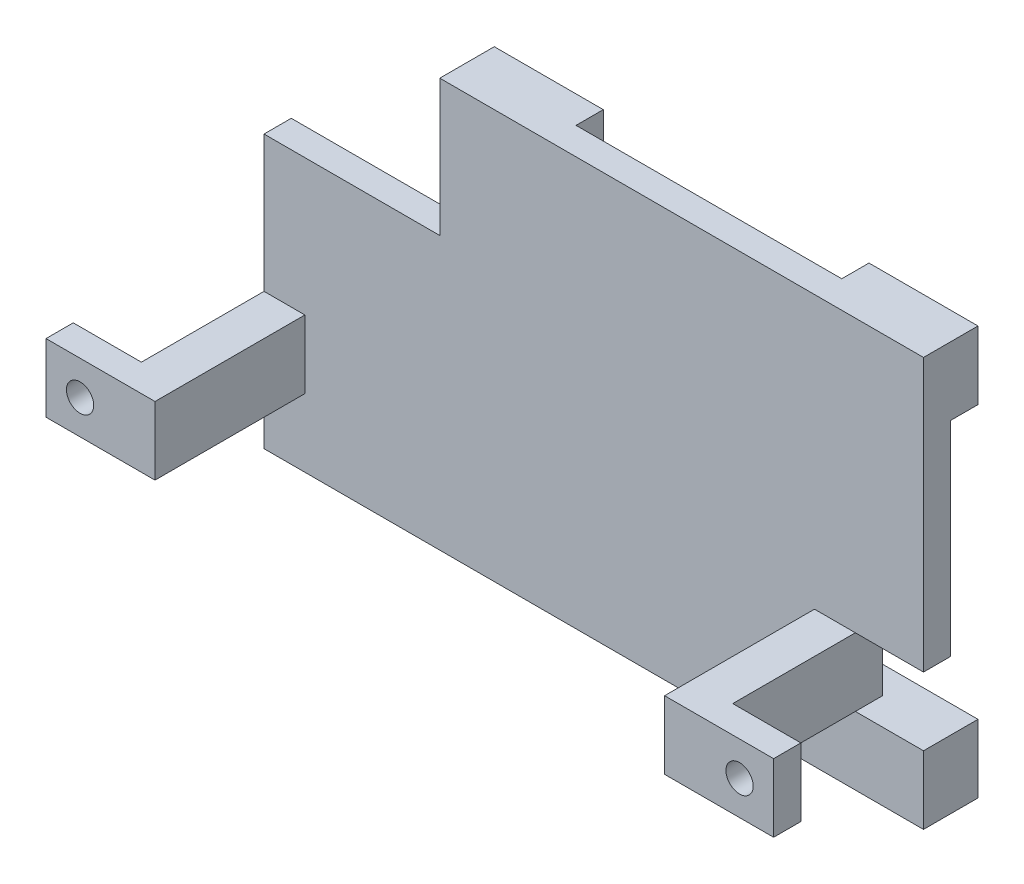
ISO-10303-21;
HEADER;
FILE_DESCRIPTION(('STEP AP214'),'2;1');
FILE_NAME('part.step','',(''),(''),'','','');
FILE_SCHEMA(('AUTOMOTIVE_DESIGN { 1 0 10303 214 1 1 1 1 }'));
ENDSEC;
DATA;
#1=APPLICATION_CONTEXT('core data for automotive mechanical design processes');
#2=APPLICATION_PROTOCOL_DEFINITION('international standard','automotive_design',2000,#1);
#3=PRODUCT_CONTEXT('',#1,'mechanical');
#4=PRODUCT('Part','Part','',(#3));
#5=PRODUCT_RELATED_PRODUCT_CATEGORY('part','',(#4));
#6=PRODUCT_DEFINITION_FORMATION('','',#4);
#7=PRODUCT_DEFINITION_CONTEXT('part definition',#1,'design');
#8=PRODUCT_DEFINITION('design','',#6,#7);
#9=PRODUCT_DEFINITION_SHAPE('','',#8);
#10=(LENGTH_UNIT() NAMED_UNIT(*) SI_UNIT(.MILLI.,.METRE.));
#11=(NAMED_UNIT(*) PLANE_ANGLE_UNIT() SI_UNIT($,.RADIAN.));
#12=(NAMED_UNIT(*) SI_UNIT($,.STERADIAN.) SOLID_ANGLE_UNIT());
#13=UNCERTAINTY_MEASURE_WITH_UNIT(LENGTH_MEASURE(1.E-05),#10,'distance_accuracy_value','');
#14=(GEOMETRIC_REPRESENTATION_CONTEXT(3) GLOBAL_UNCERTAINTY_ASSIGNED_CONTEXT((#13)) GLOBAL_UNIT_ASSIGNED_CONTEXT((#10,
#11,#12)) REPRESENTATION_CONTEXT('',''));
#15=CARTESIAN_POINT('',(0.,0.,0.));
#16=DIRECTION('',(0.,0.,1.));
#17=DIRECTION('',(1.,0.,0.));
#18=AXIS2_PLACEMENT_3D('',#15,#16,#17);
#19=CARTESIAN_POINT('',(-0.387630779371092,-16.6710198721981,0.));
#20=DIRECTION('',(0.,0.,1.));
#21=DIRECTION('',(1.,0.,0.));
#22=AXIS2_PLACEMENT_3D('',#19,#20,#21);
#23=PLANE('',#22);
#24=DIRECTION('',(0.,-1.,0.));
#25=VECTOR('',#24,1.);
#26=CARTESIAN_POINT('',(-0.387630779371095,13.3289801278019,0.));
#27=LINE('',#26,#25);
#28=CARTESIAN_POINT('',(-0.387630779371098,3.32898012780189,0.));
#29=VERTEX_POINT('',#28);
#30=CARTESIAN_POINT('',(-0.387630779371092,-16.6710198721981,0.));
#31=VERTEX_POINT('',#30);
#32=EDGE_CURVE('E307',#29,#31,#27,.T.);
#33=ORIENTED_EDGE('',*,*,#32,.F.);
#34=DIRECTION('',(-1.,0.,0.));
#35=VECTOR('',#34,1.);
#36=CARTESIAN_POINT('',(-0.387630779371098,3.32898012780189,0.));
#37=LINE('',#36,#35);
#38=CARTESIAN_POINT('',(12.5123692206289,3.32898012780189,0.));
#39=VERTEX_POINT('',#38);
#40=EDGE_CURVE('E287',#39,#29,#37,.T.);
#41=ORIENTED_EDGE('',*,*,#40,.F.);
#42=DIRECTION('',(0.,-1.,0.));
#43=VECTOR('',#42,1.);
#44=CARTESIAN_POINT('',(12.5123692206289,13.3289801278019,0.));
#45=LINE('',#44,#43);
#46=CARTESIAN_POINT('',(12.5123692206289,8.32898012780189,0.));
#47=VERTEX_POINT('',#46);
#48=EDGE_CURVE('E297',#47,#39,#45,.T.);
#49=ORIENTED_EDGE('',*,*,#48,.F.);
#50=DIRECTION('',(-1.,0.,0.));
#51=VECTOR('',#50,1.);
#52=CARTESIAN_POINT('',(12.5123692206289,8.32898012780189,0.));
#53=LINE('',#52,#51);
#54=CARTESIAN_POINT('',(20.5123692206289,8.32898012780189,0.));
#55=VERTEX_POINT('',#54);
#56=EDGE_CURVE('E350',#55,#47,#53,.T.);
#57=ORIENTED_EDGE('',*,*,#56,.F.);
#58=DIRECTION('',(0.,-1.,0.));
#59=VECTOR('',#58,1.);
#60=CARTESIAN_POINT('',(20.5123692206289,13.3289801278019,0.));
#61=LINE('',#60,#59);
#62=CARTESIAN_POINT('',(20.5123692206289,13.3289801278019,0.));
#63=VERTEX_POINT('',#62);
#64=EDGE_CURVE('E343',#63,#55,#61,.T.);
#65=ORIENTED_EDGE('',*,*,#64,.F.);
#66=DIRECTION('',(-1.,0.,0.));
#67=VECTOR('',#66,1.);
#68=CARTESIAN_POINT('',(-0.387630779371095,13.3289801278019,0.));
#69=LINE('',#68,#67);
#70=CARTESIAN_POINT('',(40.0123692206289,13.3289801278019,0.));
#71=VERTEX_POINT('',#70);
#72=EDGE_CURVE('E512',#71,#63,#69,.T.);
#73=ORIENTED_EDGE('',*,*,#72,.F.);
#74=DIRECTION('',(0.,1.,0.));
#75=VECTOR('',#74,1.);
#76=CARTESIAN_POINT('',(40.0123692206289,13.3289801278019,0.));
#77=LINE('',#76,#75);
#78=CARTESIAN_POINT('',(40.0123692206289,8.32898012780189,0.));
#79=VERTEX_POINT('',#78);
#80=EDGE_CURVE('E325',#79,#71,#77,.T.);
#81=ORIENTED_EDGE('',*,*,#80,.F.);
#82=DIRECTION('',(-1.,0.,0.));
#83=VECTOR('',#82,1.);
#84=CARTESIAN_POINT('',(48.0123692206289,8.32898012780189,0.));
#85=LINE('',#84,#83);
#86=CARTESIAN_POINT('',(48.0123692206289,8.32898012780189,0.));
#87=VERTEX_POINT('',#86);
#88=EDGE_CURVE('E318',#87,#79,#85,.T.);
#89=ORIENTED_EDGE('',*,*,#88,.F.);
#90=DIRECTION('',(0.,1.,0.));
#91=VECTOR('',#90,1.);
#92=CARTESIAN_POINT('',(48.0123692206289,13.3289801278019,0.));
#93=LINE('',#92,#91);
#94=CARTESIAN_POINT('',(48.0123692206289,-6.67101987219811,0.));
#95=VERTEX_POINT('',#94);
#96=EDGE_CURVE('E502',#95,#87,#93,.T.);
#97=ORIENTED_EDGE('',*,*,#96,.F.);
#98=DIRECTION('',(-1.,0.,0.));
#99=VECTOR('',#98,1.);
#100=CARTESIAN_POINT('',(43.0123692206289,-6.67101987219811,0.));
#101=LINE('',#100,#99);
#102=CARTESIAN_POINT('',(43.0123692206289,-6.67101987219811,0.));
#103=VERTEX_POINT('',#102);
#104=EDGE_CURVE('E1050',#95,#103,#101,.T.);
#105=ORIENTED_EDGE('',*,*,#104,.T.);
#106=DIRECTION('',(0.,-1.,0.));
#107=VECTOR('',#106,1.);
#108=CARTESIAN_POINT('',(43.0123692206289,-11.6710198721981,0.));
#109=LINE('',#108,#107);
#110=CARTESIAN_POINT('',(43.0123692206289,-11.6710198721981,0.));
#111=VERTEX_POINT('',#110);
#112=EDGE_CURVE('E1053',#103,#111,#109,.T.);
#113=ORIENTED_EDGE('',*,*,#112,.T.);
#114=DIRECTION('',(1.,0.,0.));
#115=VECTOR('',#114,1.);
#116=CARTESIAN_POINT('',(48.0123692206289,-11.6710198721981,0.));
#117=LINE('',#116,#115);
#118=CARTESIAN_POINT('',(40.0123692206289,-11.6710198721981,0.));
#119=VERTEX_POINT('',#118);
#120=EDGE_CURVE('E90',#119,#111,#117,.T.);
#121=ORIENTED_EDGE('',*,*,#120,.F.);
#122=DIRECTION('',(0.,1.,0.));
#123=VECTOR('',#122,1.);
#124=CARTESIAN_POINT('',(40.0123692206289,-16.6710198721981,0.));
#125=LINE('',#124,#123);
#126=CARTESIAN_POINT('',(40.0123692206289,-16.6710198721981,0.));
#127=VERTEX_POINT('',#126);
#128=EDGE_CURVE('E371',#127,#119,#125,.T.);
#129=ORIENTED_EDGE('',*,*,#128,.F.);
#130=DIRECTION('',(1.,0.,0.));
#131=VECTOR('',#130,1.);
#132=CARTESIAN_POINT('',(-0.387630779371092,-16.6710198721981,0.));
#133=LINE('',#132,#131);
#134=CARTESIAN_POINT('',(20.5123692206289,-16.6710198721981,0.));
#135=VERTEX_POINT('',#134);
#136=EDGE_CURVE('E503',#135,#127,#133,.T.);
#137=ORIENTED_EDGE('',*,*,#136,.F.);
#138=DIRECTION('',(0.,-1.,0.));
#139=VECTOR('',#138,1.);
#140=CARTESIAN_POINT('',(20.5123692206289,-16.6710198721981,0.));
#141=LINE('',#140,#139);
#142=CARTESIAN_POINT('',(20.5123692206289,-11.6710198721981,0.));
#143=VERTEX_POINT('',#142);
#144=EDGE_CURVE('E404',#143,#135,#141,.T.);
#145=ORIENTED_EDGE('',*,*,#144,.F.);
#146=DIRECTION('',(1.,0.,0.));
#147=VECTOR('',#146,1.);
#148=CARTESIAN_POINT('',(12.5123692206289,-11.6710198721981,0.));
#149=LINE('',#148,#147);
#150=CARTESIAN_POINT('',(12.5123692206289,-11.6710198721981,0.));
#151=VERTEX_POINT('',#150);
#152=EDGE_CURVE('E411',#151,#143,#149,.T.);
#153=ORIENTED_EDGE('',*,*,#152,.F.);
#154=DIRECTION('',(0.,1.,0.));
#155=VECTOR('',#154,1.);
#156=CARTESIAN_POINT('',(12.5123692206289,-16.6710198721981,0.));
#157=LINE('',#156,#155);
#158=CARTESIAN_POINT('',(12.5123692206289,-16.6710198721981,0.));
#159=VERTEX_POINT('',#158);
#160=EDGE_CURVE('E397',#159,#151,#157,.T.);
#161=ORIENTED_EDGE('',*,*,#160,.F.);
#162=EDGE_CURVE('E498',#31,#159,#133,.T.);
#163=ORIENTED_EDGE('',*,*,#162,.F.);
#164=EDGE_LOOP('',(#33,#41,#49,#57,#65,#73,#81,#89,#97,#105,#113,#121,#129,#137,#145,#153,#161,#163));
#165=FACE_BOUND('',#164,.T.);
#166=ADVANCED_FACE('F64',(#165),#23,.F.);
#167=CARTESIAN_POINT('',(-0.387630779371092,-16.6710198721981,2.));
#168=DIRECTION('',(0.,0.,1.));
#169=DIRECTION('',(1.,0.,0.));
#170=AXIS2_PLACEMENT_3D('',#167,#168,#169);
#171=PLANE('',#170);
#172=DIRECTION('',(1.,0.,0.));
#173=VECTOR('',#172,1.);
#174=CARTESIAN_POINT('',(-0.387630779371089,3.32898012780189,2.));
#175=LINE('',#174,#173);
#176=CARTESIAN_POINT('',(-0.387630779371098,3.32898012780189,2.));
#177=VERTEX_POINT('',#176);
#178=CARTESIAN_POINT('',(12.5123692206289,3.32898012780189,2.));
#179=VERTEX_POINT('',#178);
#180=EDGE_CURVE('E290',#177,#179,#175,.T.);
#181=ORIENTED_EDGE('',*,*,#180,.F.);
#182=DIRECTION('',(0.,-1.,0.));
#183=VECTOR('',#182,1.);
#184=CARTESIAN_POINT('',(-0.387630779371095,13.3289801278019,2.));
#185=LINE('',#184,#183);
#186=CARTESIAN_POINT('',(-0.387630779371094,-6.67101987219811,2.));
#187=VERTEX_POINT('',#186);
#188=EDGE_CURVE('E68',#177,#187,#185,.T.);
#189=ORIENTED_EDGE('',*,*,#188,.T.);
#190=DIRECTION('',(-1.,0.,0.));
#191=VECTOR('',#190,1.);
#192=CARTESIAN_POINT('',(-0.387630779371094,-6.67101987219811,2.));
#193=LINE('',#192,#191);
#194=CARTESIAN_POINT('',(2.6123692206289,-6.67101987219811,2.));
#195=VERTEX_POINT('',#194);
#196=EDGE_CURVE('E520',#195,#187,#193,.T.);
#197=ORIENTED_EDGE('',*,*,#196,.F.);
#198=DIRECTION('',(0.,1.,0.));
#199=VECTOR('',#198,1.);
#200=CARTESIAN_POINT('',(2.6123692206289,-11.6710198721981,2.));
#201=LINE('',#200,#199);
#202=CARTESIAN_POINT('',(2.6123692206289,-11.6710198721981,2.));
#203=VERTEX_POINT('',#202);
#204=EDGE_CURVE('E1025',#203,#195,#201,.T.);
#205=ORIENTED_EDGE('',*,*,#204,.F.);
#206=DIRECTION('',(1.,0.,0.));
#207=VECTOR('',#206,1.);
#208=CARTESIAN_POINT('',(-0.387630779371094,-11.6710198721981,2.));
#209=LINE('',#208,#207);
#210=CARTESIAN_POINT('',(-0.387630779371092,-11.6710198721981,2.));
#211=VERTEX_POINT('',#210);
#212=EDGE_CURVE('E1027',#211,#203,#209,.T.);
#213=ORIENTED_EDGE('',*,*,#212,.F.);
#214=CARTESIAN_POINT('',(-0.387630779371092,-16.6710198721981,2.));
#215=VERTEX_POINT('',#214);
#216=EDGE_CURVE('E514',#211,#215,#185,.T.);
#217=ORIENTED_EDGE('',*,*,#216,.T.);
#218=DIRECTION('',(1.,0.,0.));
#219=VECTOR('',#218,1.);
#220=CARTESIAN_POINT('',(-0.387630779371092,-16.6710198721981,2.));
#221=LINE('',#220,#219);
#222=CARTESIAN_POINT('',(48.0123692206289,-16.6710198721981,2.));
#223=VERTEX_POINT('',#222);
#224=EDGE_CURVE('E527',#215,#223,#221,.T.);
#225=ORIENTED_EDGE('',*,*,#224,.T.);
#226=DIRECTION('',(0.,1.,0.));
#227=VECTOR('',#226,1.);
#228=CARTESIAN_POINT('',(48.0123692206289,13.3289801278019,2.));
#229=LINE('',#228,#227);
#230=CARTESIAN_POINT('',(48.0123692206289,-11.6710198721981,2.));
#231=VERTEX_POINT('',#230);
#232=EDGE_CURVE('E531',#223,#231,#229,.T.);
#233=ORIENTED_EDGE('',*,*,#232,.T.);
#234=DIRECTION('',(1.,0.,0.));
#235=VECTOR('',#234,1.);
#236=CARTESIAN_POINT('',(48.0123692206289,-11.6710198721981,2.));
#237=LINE('',#236,#235);
#238=CARTESIAN_POINT('',(43.0123692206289,-11.6710198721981,2.));
#239=VERTEX_POINT('',#238);
#240=EDGE_CURVE('E1054',#239,#231,#237,.T.);
#241=ORIENTED_EDGE('',*,*,#240,.F.);
#242=DIRECTION('',(1.,0.,0.));
#243=VECTOR('',#242,1.);
#244=CARTESIAN_POINT('',(43.0123692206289,-11.6710198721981,2.));
#245=LINE('',#244,#243);
#246=CARTESIAN_POINT('',(40.0123692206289,-11.6710198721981,2.));
#247=VERTEX_POINT('',#246);
#248=EDGE_CURVE('E1109',#247,#239,#245,.T.);
#249=ORIENTED_EDGE('',*,*,#248,.F.);
#250=DIRECTION('',(0.,-1.,0.));
#251=VECTOR('',#250,1.);
#252=CARTESIAN_POINT('',(40.0123692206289,-6.67101987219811,2.));
#253=LINE('',#252,#251);
#254=CARTESIAN_POINT('',(40.0123692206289,-6.67101987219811,2.));
#255=VERTEX_POINT('',#254);
#256=EDGE_CURVE('E1113',#255,#247,#253,.T.);
#257=ORIENTED_EDGE('',*,*,#256,.F.);
#258=DIRECTION('',(-1.,0.,0.));
#259=VECTOR('',#258,1.);
#260=CARTESIAN_POINT('',(43.0123692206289,-6.67101987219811,2.));
#261=LINE('',#260,#259);
#262=CARTESIAN_POINT('',(43.0123692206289,-6.67101987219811,2.));
#263=VERTEX_POINT('',#262);
#264=EDGE_CURVE('E1073',#263,#255,#261,.T.);
#265=ORIENTED_EDGE('',*,*,#264,.F.);
#266=DIRECTION('',(-1.,0.,0.));
#267=VECTOR('',#266,1.);
#268=CARTESIAN_POINT('',(43.0123692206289,-6.67101987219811,2.));
#269=LINE('',#268,#267);
#270=CARTESIAN_POINT('',(48.0123692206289,-6.67101987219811,2.));
#271=VERTEX_POINT('',#270);
#272=EDGE_CURVE('E1034',#271,#263,#269,.T.);
#273=ORIENTED_EDGE('',*,*,#272,.F.);
#274=CARTESIAN_POINT('',(48.0123692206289,13.3289801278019,2.));
#275=VERTEX_POINT('',#274);
#276=EDGE_CURVE('E530',#271,#275,#229,.T.);
#277=ORIENTED_EDGE('',*,*,#276,.T.);
#278=DIRECTION('',(-1.,0.,0.));
#279=VECTOR('',#278,1.);
#280=CARTESIAN_POINT('',(-0.387630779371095,13.3289801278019,2.));
#281=LINE('',#280,#279);
#282=CARTESIAN_POINT('',(12.5123692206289,13.3289801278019,2.));
#283=VERTEX_POINT('',#282);
#284=EDGE_CURVE('E517',#275,#283,#281,.T.);
#285=ORIENTED_EDGE('',*,*,#284,.T.);
#286=DIRECTION('',(0.,1.,0.));
#287=VECTOR('',#286,1.);
#288=CARTESIAN_POINT('',(12.5123692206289,-16.6710198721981,2.));
#289=LINE('',#288,#287);
#290=EDGE_CURVE('E310',#179,#283,#289,.T.);
#291=ORIENTED_EDGE('',*,*,#290,.F.);
#292=EDGE_LOOP('',(#181,#189,#197,#205,#213,#217,#225,#233,#241,#249,#257,#265,#273,#277,#285,#291));
#293=FACE_BOUND('',#292,.T.);
#294=ADVANCED_FACE('F536',(#293),#171,.T.);
#295=CARTESIAN_POINT('',(48.0123692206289,13.3289801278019,2.));
#296=DIRECTION('',(-1.,0.,0.));
#297=DIRECTION('',(0.,-1.,0.));
#298=AXIS2_PLACEMENT_3D('',#295,#296,#297);
#299=PLANE('',#298);
#300=DIRECTION('',(0.,0.,-1.));
#301=VECTOR('',#300,1.);
#302=CARTESIAN_POINT('',(48.0123692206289,-16.6710198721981,2.));
#303=LINE('',#302,#301);
#304=CARTESIAN_POINT('',(48.0123692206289,-16.6710198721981,-2.));
#305=VERTEX_POINT('',#304);
#306=EDGE_CURVE('E74',#223,#305,#303,.T.);
#307=ORIENTED_EDGE('',*,*,#306,.T.);
#308=DIRECTION('',(0.,-1.,0.));
#309=VECTOR('',#308,1.);
#310=CARTESIAN_POINT('',(48.0123692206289,-16.6710198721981,-2.));
#311=LINE('',#310,#309);
#312=CARTESIAN_POINT('',(48.0123692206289,-11.6710198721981,-2.));
#313=VERTEX_POINT('',#312);
#314=EDGE_CURVE('E382',#313,#305,#311,.T.);
#315=ORIENTED_EDGE('',*,*,#314,.F.);
#316=DIRECTION('',(0.,0.,1.));
#317=VECTOR('',#316,1.);
#318=CARTESIAN_POINT('',(48.0123692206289,-11.6710198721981,0.));
#319=LINE('',#318,#317);
#320=EDGE_CURVE('E1059',#313,#231,#319,.T.);
#321=ORIENTED_EDGE('',*,*,#320,.T.);
#322=ORIENTED_EDGE('',*,*,#232,.F.);
#323=EDGE_LOOP('',(#307,#315,#321,#322));
#324=FACE_BOUND('',#323,.T.);
#325=ADVANCED_FACE('F574',(#324),#299,.F.);
#326=CARTESIAN_POINT('',(-0.387630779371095,13.3289801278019,2.));
#327=DIRECTION('',(1.,0.,0.));
#328=DIRECTION('',(0.,1.,0.));
#329=AXIS2_PLACEMENT_3D('',#326,#327,#328);
#330=PLANE('',#329);
#331=ORIENTED_EDGE('',*,*,#188,.F.);
#332=DIRECTION('',(0.,0.,-1.));
#333=VECTOR('',#332,1.);
#334=CARTESIAN_POINT('',(-0.387630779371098,3.32898012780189,10.));
#335=LINE('',#334,#333);
#336=EDGE_CURVE('E294',#177,#29,#335,.T.);
#337=ORIENTED_EDGE('',*,*,#336,.T.);
#338=ORIENTED_EDGE('',*,*,#32,.T.);
#339=DIRECTION('',(0.,0.,-1.));
#340=VECTOR('',#339,1.);
#341=CARTESIAN_POINT('',(-0.387630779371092,-16.6710198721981,2.));
#342=LINE('',#341,#340);
#343=EDGE_CURVE('E12',#215,#31,#342,.T.);
#344=ORIENTED_EDGE('',*,*,#343,.F.);
#345=ORIENTED_EDGE('',*,*,#216,.F.);
#346=DIRECTION('',(0.,0.,-1.));
#347=VECTOR('',#346,1.);
#348=CARTESIAN_POINT('',(-0.387630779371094,-11.6710198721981,13.));
#349=LINE('',#348,#347);
#350=CARTESIAN_POINT('',(-0.387630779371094,-11.6710198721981,11.));
#351=VERTEX_POINT('',#350);
#352=EDGE_CURVE('E1048',#351,#211,#349,.T.);
#353=ORIENTED_EDGE('',*,*,#352,.F.);
#354=DIRECTION('',(0.,1.,0.));
#355=VECTOR('',#354,1.);
#356=CARTESIAN_POINT('',(-0.387630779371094,-11.6710198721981,11.));
#357=LINE('',#356,#355);
#358=CARTESIAN_POINT('',(-0.387630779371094,-6.67101987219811,11.));
#359=VERTEX_POINT('',#358);
#360=EDGE_CURVE('E481',#351,#359,#357,.T.);
#361=ORIENTED_EDGE('',*,*,#360,.T.);
#362=DIRECTION('',(0.,0.,-1.));
#363=VECTOR('',#362,1.);
#364=CARTESIAN_POINT('',(-0.387630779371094,-6.67101987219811,13.));
#365=LINE('',#364,#363);
#366=EDGE_CURVE('E487',#359,#187,#365,.T.);
#367=ORIENTED_EDGE('',*,*,#366,.T.);
#368=EDGE_LOOP('',(#331,#337,#338,#344,#345,#353,#361,#367));
#369=FACE_BOUND('',#368,.T.);
#370=ADVANCED_FACE('F66',(#369),#330,.F.);
#371=CARTESIAN_POINT('',(-0.387630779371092,-16.6710198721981,2.));
#372=DIRECTION('',(0.,1.,0.));
#373=DIRECTION('',(0.,0.,1.));
#374=AXIS2_PLACEMENT_3D('',#371,#372,#373);
#375=PLANE('',#374);
#376=ORIENTED_EDGE('',*,*,#162,.T.);
#377=DIRECTION('',(0.,0.,1.));
#378=VECTOR('',#377,1.);
#379=CARTESIAN_POINT('',(12.5123692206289,-16.6710198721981,-2.));
#380=LINE('',#379,#378);
#381=CARTESIAN_POINT('',(12.5123692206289,-16.6710198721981,-2.));
#382=VERTEX_POINT('',#381);
#383=EDGE_CURVE('E436',#382,#159,#380,.T.);
#384=ORIENTED_EDGE('',*,*,#383,.F.);
#385=DIRECTION('',(-1.,0.,0.));
#386=VECTOR('',#385,1.);
#387=CARTESIAN_POINT('',(12.5123692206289,-16.6710198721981,-2.));
#388=LINE('',#387,#386);
#389=CARTESIAN_POINT('',(20.5123692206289,-16.6710198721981,-2.));
#390=VERTEX_POINT('',#389);
#391=EDGE_CURVE('E400',#390,#382,#388,.T.);
#392=ORIENTED_EDGE('',*,*,#391,.F.);
#393=DIRECTION('',(0.,0.,1.));
#394=VECTOR('',#393,1.);
#395=CARTESIAN_POINT('',(20.5123692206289,-16.6710198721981,-2.));
#396=LINE('',#395,#394);
#397=EDGE_CURVE('E410',#390,#135,#396,.T.);
#398=ORIENTED_EDGE('',*,*,#397,.T.);
#399=ORIENTED_EDGE('',*,*,#136,.T.);
#400=DIRECTION('',(0.,0.,1.));
#401=VECTOR('',#400,1.);
#402=CARTESIAN_POINT('',(40.0123692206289,-16.6710198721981,-2.));
#403=LINE('',#402,#401);
#404=CARTESIAN_POINT('',(40.0123692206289,-16.6710198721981,-2.));
#405=VERTEX_POINT('',#404);
#406=EDGE_CURVE('E390',#405,#127,#403,.T.);
#407=ORIENTED_EDGE('',*,*,#406,.F.);
#408=DIRECTION('',(-1.,0.,0.));
#409=VECTOR('',#408,1.);
#410=CARTESIAN_POINT('',(48.0123692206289,-16.6710198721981,-2.));
#411=LINE('',#410,#409);
#412=EDGE_CURVE('E374',#305,#405,#411,.T.);
#413=ORIENTED_EDGE('',*,*,#412,.F.);
#414=ORIENTED_EDGE('',*,*,#306,.F.);
#415=ORIENTED_EDGE('',*,*,#224,.F.);
#416=ORIENTED_EDGE('',*,*,#343,.T.);
#417=EDGE_LOOP('',(#376,#384,#392,#398,#399,#407,#413,#414,#415,#416));
#418=FACE_BOUND('',#417,.T.);
#419=ADVANCED_FACE('F791',(#418),#375,.F.);
#420=ORIENTED_EDGE('',*,*,#276,.F.);
#421=DIRECTION('',(0.,0.,1.));
#422=VECTOR('',#421,1.);
#423=CARTESIAN_POINT('',(48.0123692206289,-6.67101987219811,0.));
#424=LINE('',#423,#422);
#425=EDGE_CURVE('E525',#95,#271,#424,.T.);
#426=ORIENTED_EDGE('',*,*,#425,.F.);
#427=ORIENTED_EDGE('',*,*,#96,.T.);
#428=DIRECTION('',(0.,0.,1.));
#429=VECTOR('',#428,1.);
#430=CARTESIAN_POINT('',(48.0123692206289,8.32898012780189,-2.));
#431=LINE('',#430,#429);
#432=CARTESIAN_POINT('',(48.0123692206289,8.32898012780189,-2.));
#433=VERTEX_POINT('',#432);
#434=EDGE_CURVE('E337',#433,#87,#431,.T.);
#435=ORIENTED_EDGE('',*,*,#434,.F.);
#436=DIRECTION('',(0.,-1.,0.));
#437=VECTOR('',#436,1.);
#438=CARTESIAN_POINT('',(48.0123692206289,13.3289801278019,-2.));
#439=LINE('',#438,#437);
#440=CARTESIAN_POINT('',(48.0123692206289,13.3289801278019,-2.));
#441=VERTEX_POINT('',#440);
#442=EDGE_CURVE('E324',#441,#433,#439,.T.);
#443=ORIENTED_EDGE('',*,*,#442,.F.);
#444=DIRECTION('',(0.,0.,-1.));
#445=VECTOR('',#444,1.);
#446=CARTESIAN_POINT('',(48.0123692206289,13.3289801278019,2.));
#447=LINE('',#446,#445);
#448=EDGE_CURVE('E515',#275,#441,#447,.T.);
#449=ORIENTED_EDGE('',*,*,#448,.F.);
#450=EDGE_LOOP('',(#420,#426,#427,#435,#443,#449));
#451=FACE_BOUND('',#450,.T.);
#452=ADVANCED_FACE('F786',(#451),#299,.F.);
#453=CARTESIAN_POINT('',(-0.387630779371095,13.3289801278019,2.));
#454=DIRECTION('',(0.,-1.,0.));
#455=DIRECTION('',(0.,0.,-1.));
#456=AXIS2_PLACEMENT_3D('',#453,#454,#455);
#457=PLANE('',#456);
#458=DIRECTION('',(0.,0.,1.));
#459=VECTOR('',#458,1.);
#460=CARTESIAN_POINT('',(12.5123692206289,13.3289801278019,-2.));
#461=LINE('',#460,#459);
#462=CARTESIAN_POINT('',(12.5123692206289,13.3289801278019,-2.));
#463=VERTEX_POINT('',#462);
#464=EDGE_CURVE('E356',#463,#283,#461,.T.);
#465=ORIENTED_EDGE('',*,*,#464,.T.);
#466=ORIENTED_EDGE('',*,*,#284,.F.);
#467=ORIENTED_EDGE('',*,*,#448,.T.);
#468=DIRECTION('',(1.,0.,0.));
#469=VECTOR('',#468,1.);
#470=CARTESIAN_POINT('',(48.0123692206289,13.3289801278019,-2.));
#471=LINE('',#470,#469);
#472=CARTESIAN_POINT('',(40.0123692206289,13.3289801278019,-2.));
#473=VERTEX_POINT('',#472);
#474=EDGE_CURVE('E321',#473,#441,#471,.T.);
#475=ORIENTED_EDGE('',*,*,#474,.F.);
#476=DIRECTION('',(0.,0.,1.));
#477=VECTOR('',#476,1.);
#478=CARTESIAN_POINT('',(40.0123692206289,13.3289801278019,-2.));
#479=LINE('',#478,#477);
#480=EDGE_CURVE('E82',#473,#71,#479,.T.);
#481=ORIENTED_EDGE('',*,*,#480,.T.);
#482=ORIENTED_EDGE('',*,*,#72,.T.);
#483=DIRECTION('',(0.,0.,1.));
#484=VECTOR('',#483,1.);
#485=CARTESIAN_POINT('',(20.5123692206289,13.3289801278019,-2.));
#486=LINE('',#485,#484);
#487=CARTESIAN_POINT('',(20.5123692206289,13.3289801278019,-2.));
#488=VERTEX_POINT('',#487);
#489=EDGE_CURVE('E364',#488,#63,#486,.T.);
#490=ORIENTED_EDGE('',*,*,#489,.F.);
#491=DIRECTION('',(1.,0.,0.));
#492=VECTOR('',#491,1.);
#493=CARTESIAN_POINT('',(12.5123692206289,13.3289801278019,-2.));
#494=LINE('',#493,#492);
#495=EDGE_CURVE('E346',#463,#488,#494,.T.);
#496=ORIENTED_EDGE('',*,*,#495,.F.);
#497=EDGE_LOOP('',(#465,#466,#467,#475,#481,#482,#490,#496));
#498=FACE_BOUND('',#497,.T.);
#499=ADVANCED_FACE('F540',(#498),#457,.F.);
#500=CARTESIAN_POINT('',(48.0123692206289,-11.6710198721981,0.));
#501=DIRECTION('',(0.,-1.,0.));
#502=DIRECTION('',(0.,0.,-1.));
#503=AXIS2_PLACEMENT_3D('',#500,#501,#502);
#504=PLANE('',#503);
#505=ORIENTED_EDGE('',*,*,#240,.T.);
#506=ORIENTED_EDGE('',*,*,#320,.F.);
#507=DIRECTION('',(1.,0.,0.));
#508=VECTOR('',#507,1.);
#509=CARTESIAN_POINT('',(48.0123692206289,-11.6710198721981,-2.));
#510=LINE('',#509,#508);
#511=CARTESIAN_POINT('',(40.0123692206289,-11.6710198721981,-2.));
#512=VERTEX_POINT('',#511);
#513=EDGE_CURVE('E379',#512,#313,#510,.T.);
#514=ORIENTED_EDGE('',*,*,#513,.F.);
#515=DIRECTION('',(0.,0.,1.));
#516=VECTOR('',#515,1.);
#517=CARTESIAN_POINT('',(40.0123692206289,-11.6710198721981,-2.));
#518=LINE('',#517,#516);
#519=EDGE_CURVE('E385',#512,#119,#518,.T.);
#520=ORIENTED_EDGE('',*,*,#519,.T.);
#521=ORIENTED_EDGE('',*,*,#120,.T.);
#522=DIRECTION('',(0.,0.,1.));
#523=VECTOR('',#522,1.);
#524=CARTESIAN_POINT('',(43.0123692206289,-11.6710198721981,0.));
#525=LINE('',#524,#523);
#526=EDGE_CURVE('E1062',#111,#239,#525,.T.);
#527=ORIENTED_EDGE('',*,*,#526,.T.);
#528=EDGE_LOOP('',(#505,#506,#514,#520,#521,#527));
#529=FACE_BOUND('',#528,.T.);
#530=ADVANCED_FACE('F765',(#529),#504,.F.);
#531=CARTESIAN_POINT('',(43.0123692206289,-11.6710198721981,0.));
#532=DIRECTION('',(-1.,0.,0.));
#533=DIRECTION('',(0.,0.,1.));
#534=AXIS2_PLACEMENT_3D('',#531,#532,#533);
#535=PLANE('',#534);
#536=DIRECTION('',(0.,0.,-1.));
#537=VECTOR('',#536,1.);
#538=CARTESIAN_POINT('',(43.0123692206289,-6.67101987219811,13.));
#539=LINE('',#538,#537);
#540=CARTESIAN_POINT('',(43.0123692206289,-6.67101987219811,11.));
#541=VERTEX_POINT('',#540);
#542=EDGE_CURVE('E1106',#541,#263,#539,.T.);
#543=ORIENTED_EDGE('',*,*,#542,.F.);
#544=DIRECTION('',(0.,-1.,0.));
#545=VECTOR('',#544,1.);
#546=CARTESIAN_POINT('',(43.0123692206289,-6.67101987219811,11.));
#547=LINE('',#546,#545);
#548=CARTESIAN_POINT('',(43.0123692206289,-11.6710198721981,11.));
#549=VERTEX_POINT('',#548);
#550=EDGE_CURVE('E452',#541,#549,#547,.T.);
#551=ORIENTED_EDGE('',*,*,#550,.T.);
#552=DIRECTION('',(0.,0.,-1.));
#553=VECTOR('',#552,1.);
#554=CARTESIAN_POINT('',(43.0123692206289,-11.6710198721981,13.));
#555=LINE('',#554,#553);
#556=EDGE_CURVE('E1104',#549,#239,#555,.T.);
#557=ORIENTED_EDGE('',*,*,#556,.T.);
#558=ORIENTED_EDGE('',*,*,#526,.F.);
#559=ORIENTED_EDGE('',*,*,#112,.F.);
#560=DIRECTION('',(0.,0.,1.));
#561=VECTOR('',#560,1.);
#562=CARTESIAN_POINT('',(43.0123692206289,-6.67101987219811,0.));
#563=LINE('',#562,#561);
#564=EDGE_CURVE('E1064',#103,#263,#563,.T.);
#565=ORIENTED_EDGE('',*,*,#564,.T.);
#566=EDGE_LOOP('',(#543,#551,#557,#558,#559,#565));
#567=FACE_BOUND('',#566,.T.);
#568=ADVANCED_FACE('F759',(#567),#535,.F.);
#569=CARTESIAN_POINT('',(43.0123692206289,-6.67101987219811,0.));
#570=DIRECTION('',(0.,1.,0.));
#571=DIRECTION('',(0.,0.,1.));
#572=AXIS2_PLACEMENT_3D('',#569,#570,#571);
#573=PLANE('',#572);
#574=ORIENTED_EDGE('',*,*,#272,.T.);
#575=ORIENTED_EDGE('',*,*,#564,.F.);
#576=ORIENTED_EDGE('',*,*,#104,.F.);
#577=ORIENTED_EDGE('',*,*,#425,.T.);
#578=EDGE_LOOP('',(#574,#575,#576,#577));
#579=FACE_BOUND('',#578,.T.);
#580=ADVANCED_FACE('F764',(#579),#573,.F.);
#581=CARTESIAN_POINT('',(2.6123692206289,-11.6710198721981,13.));
#582=DIRECTION('',(-1.,0.,0.));
#583=DIRECTION('',(0.,0.,1.));
#584=AXIS2_PLACEMENT_3D('',#581,#582,#583);
#585=PLANE('',#584);
#586=ORIENTED_EDGE('',*,*,#204,.T.);
#587=DIRECTION('',(0.,0.,-1.));
#588=VECTOR('',#587,1.);
#589=CARTESIAN_POINT('',(2.6123692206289,-6.67101987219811,13.));
#590=LINE('',#589,#588);
#591=CARTESIAN_POINT('',(2.6123692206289,-6.67101987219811,13.));
#592=VERTEX_POINT('',#591);
#593=EDGE_CURVE('E1029',#592,#195,#590,.T.);
#594=ORIENTED_EDGE('',*,*,#593,.F.);
#595=DIRECTION('',(0.,1.,0.));
#596=VECTOR('',#595,1.);
#597=CARTESIAN_POINT('',(2.6123692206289,-11.6710198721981,13.));
#598=LINE('',#597,#596);
#599=CARTESIAN_POINT('',(2.6123692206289,-11.6710198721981,13.));
#600=VERTEX_POINT('',#599);
#601=EDGE_CURVE('E1098',#600,#592,#598,.T.);
#602=ORIENTED_EDGE('',*,*,#601,.F.);
#603=DIRECTION('',(0.,0.,-1.));
#604=VECTOR('',#603,1.);
#605=CARTESIAN_POINT('',(2.6123692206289,-11.6710198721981,13.));
#606=LINE('',#605,#604);
#607=EDGE_CURVE('E1038',#600,#203,#606,.T.);
#608=ORIENTED_EDGE('',*,*,#607,.T.);
#609=EDGE_LOOP('',(#586,#594,#602,#608));
#610=FACE_BOUND('',#609,.T.);
#611=ADVANCED_FACE('F936',(#610),#585,.F.);
#612=CARTESIAN_POINT('',(-0.387630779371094,-6.67101987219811,13.));
#613=DIRECTION('',(0.,-1.,0.));
#614=DIRECTION('',(0.,0.,-1.));
#615=AXIS2_PLACEMENT_3D('',#612,#613,#614);
#616=PLANE('',#615);
#617=ORIENTED_EDGE('',*,*,#196,.T.);
#618=ORIENTED_EDGE('',*,*,#366,.F.);
#619=DIRECTION('',(-1.,0.,0.));
#620=VECTOR('',#619,1.);
#621=CARTESIAN_POINT('',(-0.387630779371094,-6.67101987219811,11.));
#622=LINE('',#621,#620);
#623=CARTESIAN_POINT('',(-5.38763077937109,-6.67101987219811,11.));
#624=VERTEX_POINT('',#623);
#625=EDGE_CURVE('E485',#359,#624,#622,.T.);
#626=ORIENTED_EDGE('',*,*,#625,.T.);
#627=DIRECTION('',(0.,0.,1.));
#628=VECTOR('',#627,1.);
#629=CARTESIAN_POINT('',(-5.38763077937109,-6.67101987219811,11.));
#630=LINE('',#629,#628);
#631=CARTESIAN_POINT('',(-5.38763077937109,-6.67101987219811,13.));
#632=VERTEX_POINT('',#631);
#633=EDGE_CURVE('E1122',#624,#632,#630,.T.);
#634=ORIENTED_EDGE('',*,*,#633,.T.);
#635=DIRECTION('',(-1.,0.,0.));
#636=VECTOR('',#635,1.);
#637=CARTESIAN_POINT('',(-0.387630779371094,-6.67101987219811,13.));
#638=LINE('',#637,#636);
#639=EDGE_CURVE('E1031',#592,#632,#638,.T.);
#640=ORIENTED_EDGE('',*,*,#639,.F.);
#641=ORIENTED_EDGE('',*,*,#593,.T.);
#642=EDGE_LOOP('',(#617,#618,#626,#634,#640,#641));
#643=FACE_BOUND('',#642,.T.);
#644=ADVANCED_FACE('F925',(#643),#616,.F.);
#645=CARTESIAN_POINT('',(-0.387630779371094,-11.6710198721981,13.));
#646=DIRECTION('',(0.,1.,0.));
#647=DIRECTION('',(0.,0.,1.));
#648=AXIS2_PLACEMENT_3D('',#645,#646,#647);
#649=PLANE('',#648);
#650=ORIENTED_EDGE('',*,*,#212,.T.);
#651=ORIENTED_EDGE('',*,*,#607,.F.);
#652=DIRECTION('',(1.,0.,0.));
#653=VECTOR('',#652,1.);
#654=CARTESIAN_POINT('',(-0.387630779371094,-11.6710198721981,13.));
#655=LINE('',#654,#653);
#656=CARTESIAN_POINT('',(-5.38763077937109,-11.6710198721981,13.));
#657=VERTEX_POINT('',#656);
#658=EDGE_CURVE('E1044',#657,#600,#655,.T.);
#659=ORIENTED_EDGE('',*,*,#658,.F.);
#660=DIRECTION('',(0.,0.,1.));
#661=VECTOR('',#660,1.);
#662=CARTESIAN_POINT('',(-5.38763077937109,-11.6710198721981,11.));
#663=LINE('',#662,#661);
#664=CARTESIAN_POINT('',(-5.38763077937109,-11.6710198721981,11.));
#665=VERTEX_POINT('',#664);
#666=EDGE_CURVE('E1116',#665,#657,#663,.T.);
#667=ORIENTED_EDGE('',*,*,#666,.F.);
#668=DIRECTION('',(1.,0.,0.));
#669=VECTOR('',#668,1.);
#670=CARTESIAN_POINT('',(-0.387630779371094,-11.6710198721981,11.));
#671=LINE('',#670,#669);
#672=EDGE_CURVE('E486',#665,#351,#671,.T.);
#673=ORIENTED_EDGE('',*,*,#672,.T.);
#674=ORIENTED_EDGE('',*,*,#352,.T.);
#675=EDGE_LOOP('',(#650,#651,#659,#667,#673,#674));
#676=FACE_BOUND('',#675,.T.);
#677=ADVANCED_FACE('F914',(#676),#649,.F.);
#678=CARTESIAN_POINT('',(2.6123692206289,-6.67101987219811,13.));
#679=DIRECTION('',(0.,0.,-1.));
#680=DIRECTION('',(-1.,0.,0.));
#681=AXIS2_PLACEMENT_3D('',#678,#679,#680);
#682=PLANE('',#681);
#683=ORIENTED_EDGE('',*,*,#601,.T.);
#684=ORIENTED_EDGE('',*,*,#639,.T.);
#685=DIRECTION('',(0.,-1.,0.));
#686=VECTOR('',#685,1.);
#687=CARTESIAN_POINT('',(-5.38763077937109,-11.6710198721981,13.));
#688=LINE('',#687,#686);
#689=EDGE_CURVE('E473',#632,#657,#688,.T.);
#690=ORIENTED_EDGE('',*,*,#689,.T.);
#691=ORIENTED_EDGE('',*,*,#658,.T.);
#692=EDGE_LOOP('',(#683,#684,#690,#691));
#693=FACE_BOUND('',#692,.T.);
#694=CARTESIAN_POINT('',(-2.88763077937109,-9.17101987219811,13.));
#695=DIRECTION('',(0.,0.,1.));
#696=DIRECTION('',(1.,0.,0.));
#697=AXIS2_PLACEMENT_3D('',#694,#695,#696);
#698=CIRCLE('',#697,1.);
#699=CARTESIAN_POINT('',(-1.88763077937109,-9.17101987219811,13.));
#700=VERTEX_POINT('',#699);
#701=EDGE_CURVE('E467',#700,#700,#698,.T.);
#702=ORIENTED_EDGE('',*,*,#701,.F.);
#703=EDGE_LOOP('',(#702));
#704=FACE_BOUND('',#703,.T.);
#705=ADVANCED_FACE('F903',(#693,#704),#682,.F.);
#706=CARTESIAN_POINT('',(43.0123692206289,-6.67101987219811,13.));
#707=DIRECTION('',(0.,-1.,0.));
#708=DIRECTION('',(1.,0.,0.));
#709=AXIS2_PLACEMENT_3D('',#706,#707,#708);
#710=PLANE('',#709);
#711=ORIENTED_EDGE('',*,*,#264,.T.);
#712=DIRECTION('',(0.,0.,-1.));
#713=VECTOR('',#712,1.);
#714=CARTESIAN_POINT('',(40.0123692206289,-6.67101987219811,13.));
#715=LINE('',#714,#713);
#716=CARTESIAN_POINT('',(40.0123692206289,-6.67101987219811,13.));
#717=VERTEX_POINT('',#716);
#718=EDGE_CURVE('E1039',#717,#255,#715,.T.);
#719=ORIENTED_EDGE('',*,*,#718,.F.);
#720=DIRECTION('',(-1.,0.,0.));
#721=VECTOR('',#720,1.);
#722=CARTESIAN_POINT('',(43.0123692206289,-6.67101987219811,13.));
#723=LINE('',#722,#721);
#724=CARTESIAN_POINT('',(48.0123692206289,-6.67101987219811,13.));
#725=VERTEX_POINT('',#724);
#726=EDGE_CURVE('E1112',#725,#717,#723,.T.);
#727=ORIENTED_EDGE('',*,*,#726,.F.);
#728=DIRECTION('',(0.,0.,1.));
#729=VECTOR('',#728,1.);
#730=CARTESIAN_POINT('',(48.0123692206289,-6.67101987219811,11.));
#731=LINE('',#730,#729);
#732=CARTESIAN_POINT('',(48.0123692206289,-6.67101987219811,11.));
#733=VERTEX_POINT('',#732);
#734=EDGE_CURVE('E464',#733,#725,#731,.T.);
#735=ORIENTED_EDGE('',*,*,#734,.F.);
#736=DIRECTION('',(-1.,0.,0.));
#737=VECTOR('',#736,1.);
#738=CARTESIAN_POINT('',(43.0123692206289,-6.67101987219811,11.));
#739=LINE('',#738,#737);
#740=EDGE_CURVE('E449',#733,#541,#739,.T.);
#741=ORIENTED_EDGE('',*,*,#740,.T.);
#742=ORIENTED_EDGE('',*,*,#542,.T.);
#743=EDGE_LOOP('',(#711,#719,#727,#735,#741,#742));
#744=FACE_BOUND('',#743,.T.);
#745=ADVANCED_FACE('F899',(#744),#710,.F.);
#746=CARTESIAN_POINT('',(40.0123692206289,-6.67101987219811,13.));
#747=DIRECTION('',(1.,0.,0.));
#748=DIRECTION('',(0.,0.,-1.));
#749=AXIS2_PLACEMENT_3D('',#746,#747,#748);
#750=PLANE('',#749);
#751=ORIENTED_EDGE('',*,*,#256,.T.);
#752=DIRECTION('',(0.,0.,-1.));
#753=VECTOR('',#752,1.);
#754=CARTESIAN_POINT('',(40.0123692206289,-11.6710198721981,13.));
#755=LINE('',#754,#753);
#756=CARTESIAN_POINT('',(40.0123692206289,-11.6710198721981,13.));
#757=VERTEX_POINT('',#756);
#758=EDGE_CURVE('E1041',#757,#247,#755,.T.);
#759=ORIENTED_EDGE('',*,*,#758,.F.);
#760=DIRECTION('',(0.,-1.,0.));
#761=VECTOR('',#760,1.);
#762=CARTESIAN_POINT('',(40.0123692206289,-6.67101987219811,13.));
#763=LINE('',#762,#761);
#764=EDGE_CURVE('E1118',#717,#757,#763,.T.);
#765=ORIENTED_EDGE('',*,*,#764,.F.);
#766=ORIENTED_EDGE('',*,*,#718,.T.);
#767=EDGE_LOOP('',(#751,#759,#765,#766));
#768=FACE_BOUND('',#767,.T.);
#769=ADVANCED_FACE('F890',(#768),#750,.F.);
#770=CARTESIAN_POINT('',(43.0123692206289,-11.6710198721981,13.));
#771=DIRECTION('',(0.,1.,0.));
#772=DIRECTION('',(0.,0.,1.));
#773=AXIS2_PLACEMENT_3D('',#770,#771,#772);
#774=PLANE('',#773);
#775=ORIENTED_EDGE('',*,*,#248,.T.);
#776=ORIENTED_EDGE('',*,*,#556,.F.);
#777=DIRECTION('',(1.,0.,0.));
#778=VECTOR('',#777,1.);
#779=CARTESIAN_POINT('',(43.0123692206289,-11.6710198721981,11.));
#780=LINE('',#779,#778);
#781=CARTESIAN_POINT('',(48.0123692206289,-11.6710198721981,11.));
#782=VERTEX_POINT('',#781);
#783=EDGE_CURVE('E455',#549,#782,#780,.T.);
#784=ORIENTED_EDGE('',*,*,#783,.T.);
#785=DIRECTION('',(0.,0.,1.));
#786=VECTOR('',#785,1.);
#787=CARTESIAN_POINT('',(48.0123692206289,-11.6710198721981,11.));
#788=LINE('',#787,#786);
#789=CARTESIAN_POINT('',(48.0123692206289,-11.6710198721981,13.));
#790=VERTEX_POINT('',#789);
#791=EDGE_CURVE('E461',#782,#790,#788,.T.);
#792=ORIENTED_EDGE('',*,*,#791,.T.);
#793=DIRECTION('',(1.,0.,0.));
#794=VECTOR('',#793,1.);
#795=CARTESIAN_POINT('',(43.0123692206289,-11.6710198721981,13.));
#796=LINE('',#795,#794);
#797=EDGE_CURVE('E1108',#757,#790,#796,.T.);
#798=ORIENTED_EDGE('',*,*,#797,.F.);
#799=ORIENTED_EDGE('',*,*,#758,.T.);
#800=EDGE_LOOP('',(#775,#776,#784,#792,#798,#799));
#801=FACE_BOUND('',#800,.T.);
#802=ADVANCED_FACE('F879',(#801),#774,.F.);
#803=CARTESIAN_POINT('',(40.0123692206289,-6.67101987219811,13.));
#804=DIRECTION('',(0.,0.,1.));
#805=DIRECTION('',(1.,0.,0.));
#806=AXIS2_PLACEMENT_3D('',#803,#804,#805);
#807=PLANE('',#806);
#808=ORIENTED_EDGE('',*,*,#726,.T.);
#809=ORIENTED_EDGE('',*,*,#764,.T.);
#810=ORIENTED_EDGE('',*,*,#797,.T.);
#811=DIRECTION('',(0.,1.,0.));
#812=VECTOR('',#811,1.);
#813=CARTESIAN_POINT('',(48.0123692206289,-6.67101987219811,13.));
#814=LINE('',#813,#812);
#815=EDGE_CURVE('E446',#790,#725,#814,.T.);
#816=ORIENTED_EDGE('',*,*,#815,.T.);
#817=EDGE_LOOP('',(#808,#809,#810,#816));
#818=FACE_BOUND('',#817,.T.);
#819=CARTESIAN_POINT('',(45.5123692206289,-9.17101987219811,13.));
#820=DIRECTION('',(0.,0.,1.));
#821=DIRECTION('',(1.,0.,0.));
#822=AXIS2_PLACEMENT_3D('',#819,#820,#821);
#823=CIRCLE('',#822,0.999999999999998);
#824=CARTESIAN_POINT('',(46.5123692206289,-9.17101987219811,13.));
#825=VERTEX_POINT('',#824);
#826=EDGE_CURVE('E441',#825,#825,#823,.T.);
#827=ORIENTED_EDGE('',*,*,#826,.F.);
#828=EDGE_LOOP('',(#827));
#829=FACE_BOUND('',#828,.T.);
#830=ADVANCED_FACE('F869',(#818,#829),#807,.T.);
#831=CARTESIAN_POINT('',(-5.38763077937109,-11.6710198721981,11.));
#832=DIRECTION('',(-1.,0.,0.));
#833=DIRECTION('',(0.,0.,1.));
#834=AXIS2_PLACEMENT_3D('',#831,#832,#833);
#835=PLANE('',#834);
#836=ORIENTED_EDGE('',*,*,#689,.F.);
#837=ORIENTED_EDGE('',*,*,#633,.F.);
#838=DIRECTION('',(0.,-1.,0.));
#839=VECTOR('',#838,1.);
#840=CARTESIAN_POINT('',(-5.38763077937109,-11.6710198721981,11.));
#841=LINE('',#840,#839);
#842=EDGE_CURVE('E478',#624,#665,#841,.T.);
#843=ORIENTED_EDGE('',*,*,#842,.T.);
#844=ORIENTED_EDGE('',*,*,#666,.T.);
#845=EDGE_LOOP('',(#836,#837,#843,#844));
#846=FACE_BOUND('',#845,.T.);
#847=ADVANCED_FACE('F859',(#846),#835,.T.);
#848=CARTESIAN_POINT('',(-5.38763077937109,-11.6710198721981,11.));
#849=DIRECTION('',(0.,0.,-1.));
#850=DIRECTION('',(-1.,0.,0.));
#851=AXIS2_PLACEMENT_3D('',#848,#849,#850);
#852=PLANE('',#851);
#853=CARTESIAN_POINT('',(-2.88763077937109,-9.17101987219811,11.));
#854=DIRECTION('',(0.,0.,1.));
#855=DIRECTION('',(1.,0.,0.));
#856=AXIS2_PLACEMENT_3D('',#853,#854,#855);
#857=CIRCLE('',#856,1.);
#858=CARTESIAN_POINT('',(-1.88763077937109,-9.17101987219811,11.));
#859=VERTEX_POINT('',#858);
#860=EDGE_CURVE('E470',#859,#859,#857,.T.);
#861=ORIENTED_EDGE('',*,*,#860,.T.);
#862=EDGE_LOOP('',(#861));
#863=FACE_BOUND('',#862,.T.);
#864=ORIENTED_EDGE('',*,*,#672,.F.);
#865=ORIENTED_EDGE('',*,*,#842,.F.);
#866=ORIENTED_EDGE('',*,*,#625,.F.);
#867=ORIENTED_EDGE('',*,*,#360,.F.);
#868=EDGE_LOOP('',(#864,#865,#866,#867));
#869=FACE_BOUND('',#868,.T.);
#870=ADVANCED_FACE('F849',(#863,#869),#852,.T.);
#871=CARTESIAN_POINT('',(-2.88763077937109,-9.17101987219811,11.));
#872=DIRECTION('',(0.,0.,1.));
#873=DIRECTION('',(1.,0.,0.));
#874=AXIS2_PLACEMENT_3D('',#871,#872,#873);
#875=CYLINDRICAL_SURFACE('',#874,1.);
#876=ORIENTED_EDGE('',*,*,#860,.F.);
#877=EDGE_LOOP('',(#876));
#878=FACE_BOUND('',#877,.T.);
#879=ORIENTED_EDGE('',*,*,#701,.T.);
#880=EDGE_LOOP('',(#879));
#881=FACE_BOUND('',#880,.T.);
#882=ADVANCED_FACE('F839',(#878,#881),#875,.F.);
#883=CARTESIAN_POINT('',(48.0123692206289,-6.67101987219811,11.));
#884=DIRECTION('',(1.,0.,0.));
#885=DIRECTION('',(0.,0.,-1.));
#886=AXIS2_PLACEMENT_3D('',#883,#884,#885);
#887=PLANE('',#886);
#888=ORIENTED_EDGE('',*,*,#815,.F.);
#889=ORIENTED_EDGE('',*,*,#791,.F.);
#890=DIRECTION('',(0.,1.,0.));
#891=VECTOR('',#890,1.);
#892=CARTESIAN_POINT('',(48.0123692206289,-6.67101987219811,11.));
#893=LINE('',#892,#891);
#894=EDGE_CURVE('E458',#782,#733,#893,.T.);
#895=ORIENTED_EDGE('',*,*,#894,.T.);
#896=ORIENTED_EDGE('',*,*,#734,.T.);
#897=EDGE_LOOP('',(#888,#889,#895,#896));
#898=FACE_BOUND('',#897,.T.);
#899=ADVANCED_FACE('F829',(#898),#887,.T.);
#900=CARTESIAN_POINT('',(48.0123692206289,-6.67101987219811,11.));
#901=DIRECTION('',(0.,0.,-1.));
#902=DIRECTION('',(-1.,0.,0.));
#903=AXIS2_PLACEMENT_3D('',#900,#901,#902);
#904=PLANE('',#903);
#905=CARTESIAN_POINT('',(45.5123692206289,-9.17101987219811,11.));
#906=DIRECTION('',(0.,0.,1.));
#907=DIRECTION('',(1.,0.,0.));
#908=AXIS2_PLACEMENT_3D('',#905,#906,#907);
#909=CIRCLE('',#908,0.999999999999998);
#910=CARTESIAN_POINT('',(46.5123692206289,-9.17101987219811,11.));
#911=VERTEX_POINT('',#910);
#912=EDGE_CURVE('E443',#911,#911,#909,.T.);
#913=ORIENTED_EDGE('',*,*,#912,.T.);
#914=EDGE_LOOP('',(#913));
#915=FACE_BOUND('',#914,.T.);
#916=ORIENTED_EDGE('',*,*,#740,.F.);
#917=ORIENTED_EDGE('',*,*,#894,.F.);
#918=ORIENTED_EDGE('',*,*,#783,.F.);
#919=ORIENTED_EDGE('',*,*,#550,.F.);
#920=EDGE_LOOP('',(#916,#917,#918,#919));
#921=FACE_BOUND('',#920,.T.);
#922=ADVANCED_FACE('F819',(#915,#921),#904,.T.);
#923=CARTESIAN_POINT('',(45.5123692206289,-9.17101987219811,11.));
#924=DIRECTION('',(0.,0.,1.));
#925=DIRECTION('',(1.,0.,0.));
#926=AXIS2_PLACEMENT_3D('',#923,#924,#925);
#927=CYLINDRICAL_SURFACE('',#926,0.999999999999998);
#928=ORIENTED_EDGE('',*,*,#912,.F.);
#929=EDGE_LOOP('',(#928));
#930=FACE_BOUND('',#929,.T.);
#931=ORIENTED_EDGE('',*,*,#826,.T.);
#932=EDGE_LOOP('',(#931));
#933=FACE_BOUND('',#932,.T.);
#934=ADVANCED_FACE('F751',(#930,#933),#927,.F.);
#935=CARTESIAN_POINT('',(20.5123692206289,-16.6710198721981,-2.));
#936=DIRECTION('',(0.,0.,1.));
#937=DIRECTION('',(1.,0.,0.));
#938=AXIS2_PLACEMENT_3D('',#935,#936,#937);
#939=PLANE('',#938);
#940=ORIENTED_EDGE('',*,*,#391,.T.);
#941=DIRECTION('',(0.,1.,0.));
#942=VECTOR('',#941,1.);
#943=CARTESIAN_POINT('',(12.5123692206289,-16.6710198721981,-2.));
#944=LINE('',#943,#942);
#945=CARTESIAN_POINT('',(12.5123692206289,-11.6710198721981,-2.));
#946=VERTEX_POINT('',#945);
#947=EDGE_CURVE('E403',#382,#946,#944,.T.);
#948=ORIENTED_EDGE('',*,*,#947,.T.);
#949=DIRECTION('',(1.,0.,0.));
#950=VECTOR('',#949,1.);
#951=CARTESIAN_POINT('',(12.5123692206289,-11.6710198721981,-2.));
#952=LINE('',#951,#950);
#953=CARTESIAN_POINT('',(20.5123692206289,-11.6710198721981,-2.));
#954=VERTEX_POINT('',#953);
#955=EDGE_CURVE('E406',#946,#954,#952,.T.);
#956=ORIENTED_EDGE('',*,*,#955,.T.);
#957=DIRECTION('',(0.,-1.,0.));
#958=VECTOR('',#957,1.);
#959=CARTESIAN_POINT('',(20.5123692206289,-16.6710198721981,-2.));
#960=LINE('',#959,#958);
#961=EDGE_CURVE('E408',#954,#390,#960,.T.);
#962=ORIENTED_EDGE('',*,*,#961,.T.);
#963=EDGE_LOOP('',(#940,#948,#956,#962));
#964=FACE_BOUND('',#963,.T.);
#965=CARTESIAN_POINT('',(14.5123692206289,-14.1710198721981,-2.));
#966=DIRECTION('',(0.,0.,-1.));
#967=DIRECTION('',(-1.,0.,0.));
#968=AXIS2_PLACEMENT_3D('',#965,#966,#967);
#969=CIRCLE('',#968,1.);
#970=CARTESIAN_POINT('',(13.5123692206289,-14.1710198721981,-2.));
#971=VERTEX_POINT('',#970);
#972=EDGE_CURVE('E394',#971,#971,#969,.T.);
#973=ORIENTED_EDGE('',*,*,#972,.F.);
#974=EDGE_LOOP('',(#973));
#975=FACE_BOUND('',#974,.T.);
#976=ADVANCED_FACE('F741',(#964,#975),#939,.F.);
#977=CARTESIAN_POINT('',(12.5123692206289,-16.6710198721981,-2.));
#978=DIRECTION('',(1.,0.,0.));
#979=DIRECTION('',(0.,0.,-1.));
#980=AXIS2_PLACEMENT_3D('',#977,#978,#979);
#981=PLANE('',#980);
#982=ORIENTED_EDGE('',*,*,#160,.T.);
#983=DIRECTION('',(0.,0.,1.));
#984=VECTOR('',#983,1.);
#985=CARTESIAN_POINT('',(12.5123692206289,-11.6710198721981,-2.));
#986=LINE('',#985,#984);
#987=EDGE_CURVE('E431',#946,#151,#986,.T.);
#988=ORIENTED_EDGE('',*,*,#987,.F.);
#989=ORIENTED_EDGE('',*,*,#947,.F.);
#990=ORIENTED_EDGE('',*,*,#383,.T.);
#991=EDGE_LOOP('',(#982,#988,#989,#990));
#992=FACE_BOUND('',#991,.T.);
#993=ADVANCED_FACE('F732',(#992),#981,.F.);
#994=CARTESIAN_POINT('',(12.5123692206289,-11.6710198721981,-2.));
#995=DIRECTION('',(0.,-1.,0.));
#996=DIRECTION('',(1.,0.,0.));
#997=AXIS2_PLACEMENT_3D('',#994,#995,#996);
#998=PLANE('',#997);
#999=ORIENTED_EDGE('',*,*,#152,.T.);
#1000=DIRECTION('',(0.,0.,1.));
#1001=VECTOR('',#1000,1.);
#1002=CARTESIAN_POINT('',(20.5123692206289,-11.6710198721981,-2.));
#1003=LINE('',#1002,#1001);
#1004=EDGE_CURVE('E416',#954,#143,#1003,.T.);
#1005=ORIENTED_EDGE('',*,*,#1004,.F.);
#1006=ORIENTED_EDGE('',*,*,#955,.F.);
#1007=ORIENTED_EDGE('',*,*,#987,.T.);
#1008=EDGE_LOOP('',(#999,#1005,#1006,#1007));
#1009=FACE_BOUND('',#1008,.T.);
#1010=ADVANCED_FACE('F723',(#1009),#998,.F.);
#1011=CARTESIAN_POINT('',(20.5123692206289,-16.6710198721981,-2.));
#1012=DIRECTION('',(-1.,0.,0.));
#1013=DIRECTION('',(0.,0.,1.));
#1014=AXIS2_PLACEMENT_3D('',#1011,#1012,#1013);
#1015=PLANE('',#1014);
#1016=ORIENTED_EDGE('',*,*,#144,.T.);
#1017=ORIENTED_EDGE('',*,*,#397,.F.);
#1018=ORIENTED_EDGE('',*,*,#961,.F.);
#1019=ORIENTED_EDGE('',*,*,#1004,.T.);
#1020=EDGE_LOOP('',(#1016,#1017,#1018,#1019));
#1021=FACE_BOUND('',#1020,.T.);
#1022=ADVANCED_FACE('F592',(#1021),#1015,.F.);
#1023=CARTESIAN_POINT('',(14.5123692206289,-14.1710198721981,-2.));
#1024=DIRECTION('',(0.,0.,1.));
#1025=DIRECTION('',(1.,0.,0.));
#1026=AXIS2_PLACEMENT_3D('',#1023,#1024,#1025);
#1027=CYLINDRICAL_SURFACE('',#1026,1.);
#1028=ORIENTED_EDGE('',*,*,#972,.T.);
#1029=EDGE_LOOP('',(#1028));
#1030=FACE_BOUND('',#1029,.T.);
#1031=CARTESIAN_POINT('',(14.5123692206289,-14.1710198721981,0.));
#1032=DIRECTION('',(0.,0.,-1.));
#1033=DIRECTION('',(-1.,0.,0.));
#1034=AXIS2_PLACEMENT_3D('',#1031,#1032,#1033);
#1035=CIRCLE('',#1034,1.);
#1036=CARTESIAN_POINT('',(13.5123692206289,-14.1710198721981,0.));
#1037=VERTEX_POINT('',#1036);
#1038=EDGE_CURVE('E393',#1037,#1037,#1035,.T.);
#1039=ORIENTED_EDGE('',*,*,#1038,.F.);
#1040=EDGE_LOOP('',(#1039));
#1041=FACE_BOUND('',#1040,.T.);
#1042=ADVANCED_FACE('F583',(#1030,#1041),#1027,.F.);
#1043=ORIENTED_EDGE('',*,*,#1038,.T.);
#1044=EDGE_LOOP('',(#1043));
#1045=FACE_BOUND('',#1044,.T.);
#1046=ADVANCED_FACE('F570',(#1045),#23,.F.);
#1047=CARTESIAN_POINT('',(40.0123692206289,-16.6710198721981,-2.));
#1048=DIRECTION('',(0.,0.,-1.));
#1049=DIRECTION('',(-1.,0.,0.));
#1050=AXIS2_PLACEMENT_3D('',#1047,#1048,#1049);
#1051=PLANE('',#1050);
#1052=ORIENTED_EDGE('',*,*,#412,.T.);
#1053=DIRECTION('',(0.,1.,0.));
#1054=VECTOR('',#1053,1.);
#1055=CARTESIAN_POINT('',(40.0123692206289,-16.6710198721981,-2.));
#1056=LINE('',#1055,#1054);
#1057=EDGE_CURVE('E377',#405,#512,#1056,.T.);
#1058=ORIENTED_EDGE('',*,*,#1057,.T.);
#1059=ORIENTED_EDGE('',*,*,#513,.T.);
#1060=ORIENTED_EDGE('',*,*,#314,.T.);
#1061=EDGE_LOOP('',(#1052,#1058,#1059,#1060));
#1062=FACE_BOUND('',#1061,.T.);
#1063=CARTESIAN_POINT('',(44.5123692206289,-14.1710198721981,-2.));
#1064=DIRECTION('',(0.,0.,-1.));
#1065=DIRECTION('',(-1.,0.,0.));
#1066=AXIS2_PLACEMENT_3D('',#1063,#1064,#1065);
#1067=CIRCLE('',#1066,0.999999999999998);
#1068=CARTESIAN_POINT('',(43.5123692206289,-14.1710198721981,-2.));
#1069=VERTEX_POINT('',#1068);
#1070=EDGE_CURVE('E368',#1069,#1069,#1067,.T.);
#1071=ORIENTED_EDGE('',*,*,#1070,.F.);
#1072=EDGE_LOOP('',(#1071));
#1073=FACE_BOUND('',#1072,.T.);
#1074=ADVANCED_FACE('F582',(#1062,#1073),#1051,.T.);
#1075=CARTESIAN_POINT('',(40.0123692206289,-16.6710198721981,-2.));
#1076=DIRECTION('',(1.,0.,0.));
#1077=DIRECTION('',(0.,0.,-1.));
#1078=AXIS2_PLACEMENT_3D('',#1075,#1076,#1077);
#1079=PLANE('',#1078);
#1080=ORIENTED_EDGE('',*,*,#128,.T.);
#1081=ORIENTED_EDGE('',*,*,#519,.F.);
#1082=ORIENTED_EDGE('',*,*,#1057,.F.);
#1083=ORIENTED_EDGE('',*,*,#406,.T.);
#1084=EDGE_LOOP('',(#1080,#1081,#1082,#1083));
#1085=FACE_BOUND('',#1084,.T.);
#1086=ADVANCED_FACE('F589',(#1085),#1079,.F.);
#1087=CARTESIAN_POINT('',(44.5123692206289,-14.1710198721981,-2.));
#1088=DIRECTION('',(0.,0.,1.));
#1089=DIRECTION('',(1.,0.,0.));
#1090=AXIS2_PLACEMENT_3D('',#1087,#1088,#1089);
#1091=CYLINDRICAL_SURFACE('',#1090,0.999999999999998);
#1092=ORIENTED_EDGE('',*,*,#1070,.T.);
#1093=EDGE_LOOP('',(#1092));
#1094=FACE_BOUND('',#1093,.T.);
#1095=CARTESIAN_POINT('',(44.5123692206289,-14.1710198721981,0.));
#1096=DIRECTION('',(0.,0.,-1.));
#1097=DIRECTION('',(-1.,0.,0.));
#1098=AXIS2_PLACEMENT_3D('',#1095,#1096,#1097);
#1099=CIRCLE('',#1098,0.999999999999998);
#1100=CARTESIAN_POINT('',(43.5123692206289,-14.1710198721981,0.));
#1101=VERTEX_POINT('',#1100);
#1102=EDGE_CURVE('E367',#1101,#1101,#1099,.T.);
#1103=ORIENTED_EDGE('',*,*,#1102,.F.);
#1104=EDGE_LOOP('',(#1103));
#1105=FACE_BOUND('',#1104,.T.);
#1106=ADVANCED_FACE('F596',(#1094,#1105),#1091,.F.);
#1107=ORIENTED_EDGE('',*,*,#1102,.T.);
#1108=EDGE_LOOP('',(#1107));
#1109=FACE_BOUND('',#1108,.T.);
#1110=ADVANCED_FACE('F564',(#1109),#23,.F.);
#1111=CARTESIAN_POINT('',(20.5123692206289,13.3289801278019,-2.));
#1112=DIRECTION('',(0.,0.,-1.));
#1113=DIRECTION('',(-1.,0.,0.));
#1114=AXIS2_PLACEMENT_3D('',#1111,#1112,#1113);
#1115=PLANE('',#1114);
#1116=ORIENTED_EDGE('',*,*,#495,.T.);
#1117=DIRECTION('',(0.,-1.,0.));
#1118=VECTOR('',#1117,1.);
#1119=CARTESIAN_POINT('',(20.5123692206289,13.3289801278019,-2.));
#1120=LINE('',#1119,#1118);
#1121=CARTESIAN_POINT('',(20.5123692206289,8.32898012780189,-2.));
#1122=VERTEX_POINT('',#1121);
#1123=EDGE_CURVE('E349',#488,#1122,#1120,.T.);
#1124=ORIENTED_EDGE('',*,*,#1123,.T.);
#1125=DIRECTION('',(-1.,0.,0.));
#1126=VECTOR('',#1125,1.);
#1127=CARTESIAN_POINT('',(12.5123692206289,8.32898012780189,-2.));
#1128=LINE('',#1127,#1126);
#1129=CARTESIAN_POINT('',(12.5123692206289,8.32898012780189,-2.));
#1130=VERTEX_POINT('',#1129);
#1131=EDGE_CURVE('E352',#1122,#1130,#1128,.T.);
#1132=ORIENTED_EDGE('',*,*,#1131,.T.);
#1133=DIRECTION('',(0.,1.,0.));
#1134=VECTOR('',#1133,1.);
#1135=CARTESIAN_POINT('',(12.5123692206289,13.3289801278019,-2.));
#1136=LINE('',#1135,#1134);
#1137=EDGE_CURVE('E354',#1130,#463,#1136,.T.);
#1138=ORIENTED_EDGE('',*,*,#1137,.T.);
#1139=EDGE_LOOP('',(#1116,#1124,#1132,#1138));
#1140=FACE_BOUND('',#1139,.T.);
#1141=CARTESIAN_POINT('',(14.5123692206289,10.8289801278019,-2.));
#1142=DIRECTION('',(0.,0.,-1.));
#1143=DIRECTION('',(-1.,0.,0.));
#1144=AXIS2_PLACEMENT_3D('',#1141,#1142,#1143);
#1145=CIRCLE('',#1144,1.);
#1146=CARTESIAN_POINT('',(13.5123692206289,10.8289801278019,-2.));
#1147=VERTEX_POINT('',#1146);
#1148=EDGE_CURVE('E340',#1147,#1147,#1145,.T.);
#1149=ORIENTED_EDGE('',*,*,#1148,.F.);
#1150=EDGE_LOOP('',(#1149));
#1151=FACE_BOUND('',#1150,.T.);
#1152=ADVANCED_FACE('F546',(#1140,#1151),#1115,.T.);
#1153=CARTESIAN_POINT('',(20.5123692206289,13.3289801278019,-2.));
#1154=DIRECTION('',(-1.,0.,0.));
#1155=DIRECTION('',(0.,0.,1.));
#1156=AXIS2_PLACEMENT_3D('',#1153,#1154,#1155);
#1157=PLANE('',#1156);
#1158=ORIENTED_EDGE('',*,*,#64,.T.);
#1159=DIRECTION('',(0.,0.,1.));
#1160=VECTOR('',#1159,1.);
#1161=CARTESIAN_POINT('',(20.5123692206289,8.32898012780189,-2.));
#1162=LINE('',#1161,#1160);
#1163=EDGE_CURVE('E361',#1122,#55,#1162,.T.);
#1164=ORIENTED_EDGE('',*,*,#1163,.F.);
#1165=ORIENTED_EDGE('',*,*,#1123,.F.);
#1166=ORIENTED_EDGE('',*,*,#489,.T.);
#1167=EDGE_LOOP('',(#1158,#1164,#1165,#1166));
#1168=FACE_BOUND('',#1167,.T.);
#1169=ADVANCED_FACE('F556',(#1168),#1157,.F.);
#1170=CARTESIAN_POINT('',(12.5123692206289,8.32898012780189,-2.));
#1171=DIRECTION('',(0.,1.,0.));
#1172=DIRECTION('',(0.,0.,1.));
#1173=AXIS2_PLACEMENT_3D('',#1170,#1171,#1172);
#1174=PLANE('',#1173);
#1175=ORIENTED_EDGE('',*,*,#56,.T.);
#1176=DIRECTION('',(0.,0.,1.));
#1177=VECTOR('',#1176,1.);
#1178=CARTESIAN_POINT('',(12.5123692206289,8.32898012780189,-2.));
#1179=LINE('',#1178,#1177);
#1180=EDGE_CURVE('E301',#1130,#47,#1179,.T.);
#1181=ORIENTED_EDGE('',*,*,#1180,.F.);
#1182=ORIENTED_EDGE('',*,*,#1131,.F.);
#1183=ORIENTED_EDGE('',*,*,#1163,.T.);
#1184=EDGE_LOOP('',(#1175,#1181,#1182,#1183));
#1185=FACE_BOUND('',#1184,.T.);
#1186=ADVANCED_FACE('F551',(#1185),#1174,.F.);
#1187=CARTESIAN_POINT('',(12.5123692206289,13.3289801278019,-2.));
#1188=DIRECTION('',(1.,0.,0.));
#1189=DIRECTION('',(0.,0.,-1.));
#1190=AXIS2_PLACEMENT_3D('',#1187,#1188,#1189);
#1191=PLANE('',#1190);
#1192=ORIENTED_EDGE('',*,*,#1180,.T.);
#1193=ORIENTED_EDGE('',*,*,#48,.T.);
#1194=DIRECTION('',(0.,0.,-1.));
#1195=VECTOR('',#1194,1.);
#1196=CARTESIAN_POINT('',(12.5123692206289,3.32898012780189,10.));
#1197=LINE('',#1196,#1195);
#1198=EDGE_CURVE('E283',#179,#39,#1197,.T.);
#1199=ORIENTED_EDGE('',*,*,#1198,.F.);
#1200=ORIENTED_EDGE('',*,*,#290,.T.);
#1201=ORIENTED_EDGE('',*,*,#464,.F.);
#1202=ORIENTED_EDGE('',*,*,#1137,.F.);
#1203=EDGE_LOOP('',(#1192,#1193,#1199,#1200,#1201,#1202));
#1204=FACE_BOUND('',#1203,.T.);
#1205=ADVANCED_FACE('F298',(#1204),#1191,.F.);
#1206=CARTESIAN_POINT('',(14.5123692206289,10.8289801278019,-2.));
#1207=DIRECTION('',(0.,0.,1.));
#1208=DIRECTION('',(1.,0.,0.));
#1209=AXIS2_PLACEMENT_3D('',#1206,#1207,#1208);
#1210=CYLINDRICAL_SURFACE('',#1209,1.);
#1211=ORIENTED_EDGE('',*,*,#1148,.T.);
#1212=EDGE_LOOP('',(#1211));
#1213=FACE_BOUND('',#1212,.T.);
#1214=CARTESIAN_POINT('',(14.5123692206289,10.8289801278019,0.));
#1215=DIRECTION('',(0.,0.,-1.));
#1216=DIRECTION('',(-1.,0.,0.));
#1217=AXIS2_PLACEMENT_3D('',#1214,#1215,#1216);
#1218=CIRCLE('',#1217,1.);
#1219=CARTESIAN_POINT('',(13.5123692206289,10.8289801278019,0.));
#1220=VERTEX_POINT('',#1219);
#1221=EDGE_CURVE('E339',#1220,#1220,#1218,.T.);
#1222=ORIENTED_EDGE('',*,*,#1221,.F.);
#1223=EDGE_LOOP('',(#1222));
#1224=FACE_BOUND('',#1223,.T.);
#1225=ADVANCED_FACE('F604',(#1213,#1224),#1210,.F.);
#1226=ORIENTED_EDGE('',*,*,#1221,.T.);
#1227=EDGE_LOOP('',(#1226));
#1228=FACE_BOUND('',#1227,.T.);
#1229=ADVANCED_FACE('F580',(#1228),#23,.F.);
#1230=CARTESIAN_POINT('',(40.0123692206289,13.3289801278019,-2.));
#1231=DIRECTION('',(0.,0.,1.));
#1232=DIRECTION('',(1.,0.,0.));
#1233=AXIS2_PLACEMENT_3D('',#1230,#1231,#1232);
#1234=PLANE('',#1233);
#1235=ORIENTED_EDGE('',*,*,#474,.T.);
#1236=ORIENTED_EDGE('',*,*,#442,.T.);
#1237=DIRECTION('',(-1.,0.,0.));
#1238=VECTOR('',#1237,1.);
#1239=CARTESIAN_POINT('',(48.0123692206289,8.32898012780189,-2.));
#1240=LINE('',#1239,#1238);
#1241=CARTESIAN_POINT('',(40.0123692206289,8.32898012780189,-2.));
#1242=VERTEX_POINT('',#1241);
#1243=EDGE_CURVE('E327',#433,#1242,#1240,.T.);
#1244=ORIENTED_EDGE('',*,*,#1243,.T.);
#1245=DIRECTION('',(0.,1.,0.));
#1246=VECTOR('',#1245,1.);
#1247=CARTESIAN_POINT('',(40.0123692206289,13.3289801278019,-2.));
#1248=LINE('',#1247,#1246);
#1249=EDGE_CURVE('E329',#1242,#473,#1248,.T.);
#1250=ORIENTED_EDGE('',*,*,#1249,.T.);
#1251=EDGE_LOOP('',(#1235,#1236,#1244,#1250));
#1252=FACE_BOUND('',#1251,.T.);
#1253=CARTESIAN_POINT('',(44.5123692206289,10.8289801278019,-2.));
#1254=DIRECTION('',(0.,0.,-1.));
#1255=DIRECTION('',(-1.,0.,0.));
#1256=AXIS2_PLACEMENT_3D('',#1253,#1254,#1255);
#1257=CIRCLE('',#1256,0.999999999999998);
#1258=CARTESIAN_POINT('',(43.5123692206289,10.8289801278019,-2.));
#1259=VERTEX_POINT('',#1258);
#1260=EDGE_CURVE('E315',#1259,#1259,#1257,.T.);
#1261=ORIENTED_EDGE('',*,*,#1260,.F.);
#1262=EDGE_LOOP('',(#1261));
#1263=FACE_BOUND('',#1262,.T.);
#1264=ADVANCED_FACE('F603',(#1252,#1263),#1234,.F.);
#1265=CARTESIAN_POINT('',(48.0123692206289,8.32898012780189,-2.));
#1266=DIRECTION('',(0.,1.,0.));
#1267=DIRECTION('',(-1.,0.,0.));
#1268=AXIS2_PLACEMENT_3D('',#1265,#1266,#1267);
#1269=PLANE('',#1268);
#1270=ORIENTED_EDGE('',*,*,#88,.T.);
#1271=DIRECTION('',(0.,0.,1.));
#1272=VECTOR('',#1271,1.);
#1273=CARTESIAN_POINT('',(40.0123692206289,8.32898012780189,-2.));
#1274=LINE('',#1273,#1272);
#1275=EDGE_CURVE('E334',#1242,#79,#1274,.T.);
#1276=ORIENTED_EDGE('',*,*,#1275,.F.);
#1277=ORIENTED_EDGE('',*,*,#1243,.F.);
#1278=ORIENTED_EDGE('',*,*,#434,.T.);
#1279=EDGE_LOOP('',(#1270,#1276,#1277,#1278));
#1280=FACE_BOUND('',#1279,.T.);
#1281=ADVANCED_FACE('F610',(#1280),#1269,.F.);
#1282=CARTESIAN_POINT('',(40.0123692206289,13.3289801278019,-2.));
#1283=DIRECTION('',(1.,0.,0.));
#1284=DIRECTION('',(0.,0.,-1.));
#1285=AXIS2_PLACEMENT_3D('',#1282,#1283,#1284);
#1286=PLANE('',#1285);
#1287=ORIENTED_EDGE('',*,*,#80,.T.);
#1288=ORIENTED_EDGE('',*,*,#480,.F.);
#1289=ORIENTED_EDGE('',*,*,#1249,.F.);
#1290=ORIENTED_EDGE('',*,*,#1275,.T.);
#1291=EDGE_LOOP('',(#1287,#1288,#1289,#1290));
#1292=FACE_BOUND('',#1291,.T.);
#1293=ADVANCED_FACE('F624',(#1292),#1286,.F.);
#1294=CARTESIAN_POINT('',(44.5123692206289,10.8289801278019,-2.));
#1295=DIRECTION('',(0.,0.,1.));
#1296=DIRECTION('',(1.,0.,0.));
#1297=AXIS2_PLACEMENT_3D('',#1294,#1295,#1296);
#1298=CYLINDRICAL_SURFACE('',#1297,0.999999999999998);
#1299=ORIENTED_EDGE('',*,*,#1260,.T.);
#1300=EDGE_LOOP('',(#1299));
#1301=FACE_BOUND('',#1300,.T.);
#1302=CARTESIAN_POINT('',(44.5123692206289,10.8289801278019,0.));
#1303=DIRECTION('',(0.,0.,-1.));
#1304=DIRECTION('',(-1.,0.,0.));
#1305=AXIS2_PLACEMENT_3D('',#1302,#1303,#1304);
#1306=CIRCLE('',#1305,0.999999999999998);
#1307=CARTESIAN_POINT('',(43.5123692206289,10.8289801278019,0.));
#1308=VERTEX_POINT('',#1307);
#1309=EDGE_CURVE('E314',#1308,#1308,#1306,.T.);
#1310=ORIENTED_EDGE('',*,*,#1309,.F.);
#1311=EDGE_LOOP('',(#1310));
#1312=FACE_BOUND('',#1311,.T.);
#1313=ADVANCED_FACE('F578',(#1301,#1312),#1298,.F.);
#1314=ORIENTED_EDGE('',*,*,#1309,.T.);
#1315=EDGE_LOOP('',(#1314));
#1316=FACE_BOUND('',#1315,.T.);
#1317=ADVANCED_FACE('F569',(#1316),#23,.F.);
#1318=CARTESIAN_POINT('',(-0.387630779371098,3.32898012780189,10.));
#1319=DIRECTION('',(0.,-1.,0.));
#1320=DIRECTION('',(1.,0.,0.));
#1321=AXIS2_PLACEMENT_3D('',#1318,#1319,#1320);
#1322=PLANE('',#1321);
#1323=ORIENTED_EDGE('',*,*,#180,.T.);
#1324=ORIENTED_EDGE('',*,*,#1198,.T.);
#1325=ORIENTED_EDGE('',*,*,#40,.T.);
#1326=ORIENTED_EDGE('',*,*,#336,.F.);
#1327=EDGE_LOOP('',(#1323,#1324,#1325,#1326));
#1328=FACE_BOUND('',#1327,.T.);
#1329=ADVANCED_FACE('F285',(#1328),#1322,.F.);
#1330=CLOSED_SHELL('',(#166,#294,#325,#370,#419,#452,#499,#530,#568,#580,#611,#644,#677,#705,
#745,#769,#802,#830,#847,#870,#882,#899,#922,#934,#976,#993,#1010,#1022,#1042,#1046,#1074,#1086,
#1106,#1110,#1152,#1169,#1186,#1205,#1225,#1229,#1264,#1281,#1293,#1313,#1317,#1329));
#1331=MANIFOLD_SOLID_BREP('B2',#1330);
#1332=ADVANCED_BREP_SHAPE_REPRESENTATION('',(#18,#1331),#14);
#1333=SHAPE_DEFINITION_REPRESENTATION(#9,#1332);
ENDSEC;
END-ISO-10303-21;
